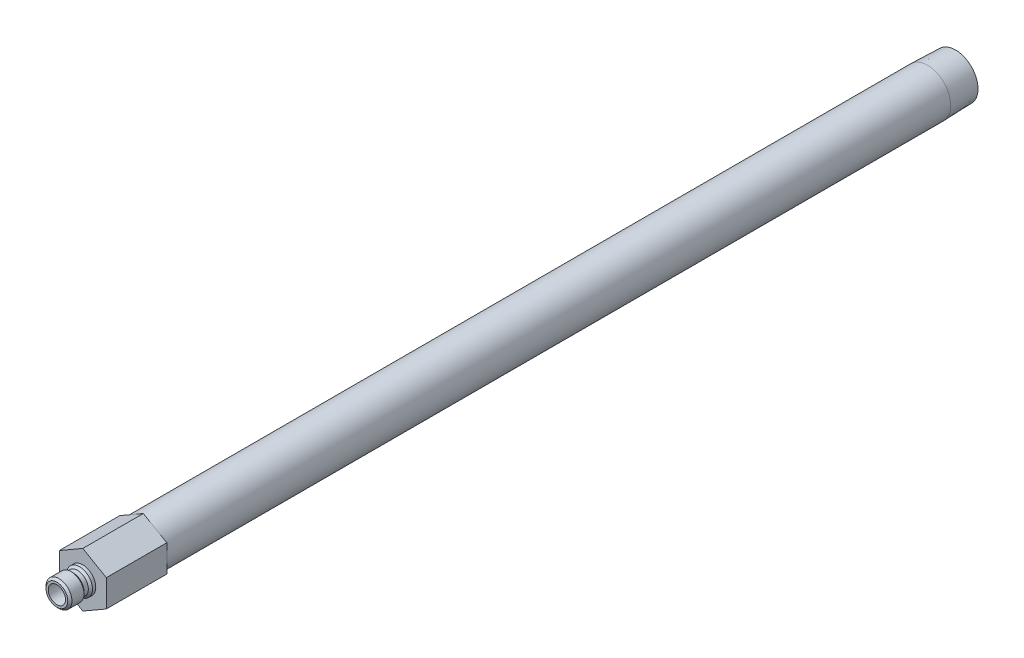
ISO-10303-21;
HEADER;
FILE_DESCRIPTION(('STEP AP214'),'2;1');
FILE_NAME('part.step','',(''),(''),'','','');
FILE_SCHEMA(('AUTOMOTIVE_DESIGN { 1 0 10303 214 1 1 1 1 }'));
ENDSEC;
DATA;
#1=APPLICATION_CONTEXT('core data for automotive mechanical design processes');
#2=APPLICATION_PROTOCOL_DEFINITION('international standard','automotive_design',2000,#1);
#3=PRODUCT_CONTEXT('',#1,'mechanical');
#4=PRODUCT('Part','Part','',(#3));
#5=PRODUCT_RELATED_PRODUCT_CATEGORY('part','',(#4));
#6=PRODUCT_DEFINITION_FORMATION('','',#4);
#7=PRODUCT_DEFINITION_CONTEXT('part definition',#1,'design');
#8=PRODUCT_DEFINITION('design','',#6,#7);
#9=PRODUCT_DEFINITION_SHAPE('','',#8);
#10=(LENGTH_UNIT() NAMED_UNIT(*) SI_UNIT(.MILLI.,.METRE.));
#11=(NAMED_UNIT(*) PLANE_ANGLE_UNIT() SI_UNIT($,.RADIAN.));
#12=(NAMED_UNIT(*) SI_UNIT($,.STERADIAN.) SOLID_ANGLE_UNIT());
#13=UNCERTAINTY_MEASURE_WITH_UNIT(LENGTH_MEASURE(1.E-05),#10,'distance_accuracy_value','');
#14=(GEOMETRIC_REPRESENTATION_CONTEXT(3) GLOBAL_UNCERTAINTY_ASSIGNED_CONTEXT((#13)) GLOBAL_UNIT_ASSIGNED_CONTEXT((#10,
#11,#12)) REPRESENTATION_CONTEXT('',''));
#15=CARTESIAN_POINT('',(0.,0.,0.));
#16=DIRECTION('',(0.,0.,1.));
#17=DIRECTION('',(1.,0.,0.));
#18=AXIS2_PLACEMENT_3D('',#15,#16,#17);
#19=CARTESIAN_POINT('',(0.,0.,0.));
#20=DIRECTION('',(0.,0.,-1.));
#21=DIRECTION('',(0.,1.,0.));
#22=AXIS2_PLACEMENT_3D('',#19,#20,#21);
#23=CYLINDRICAL_SURFACE('',#22,8.57249999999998);
#24=CARTESIAN_POINT('',(0.,0.,-310.3372));
#25=DIRECTION('',(0.,0.,-1.));
#26=DIRECTION('',(0.,1.,0.));
#27=AXIS2_PLACEMENT_3D('',#24,#25,#26);
#28=CIRCLE('',#27,8.57249999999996);
#29=CARTESIAN_POINT('',(0.,8.5725,-310.3372));
#30=VERTEX_POINT('',#29);
#31=EDGE_CURVE('E168',#30,#30,#28,.T.);
#32=ORIENTED_EDGE('',*,*,#31,.F.);
#33=EDGE_LOOP('',(#32));
#34=FACE_BOUND('',#33,.T.);
#35=CARTESIAN_POINT('',(0.,0.,-22.225));
#36=DIRECTION('',(0.,0.,1.));
#37=DIRECTION('',(1.,0.,0.));
#38=AXIS2_PLACEMENT_3D('',#35,#36,#37);
#39=CIRCLE('',#38,8.57249999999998);
#40=CARTESIAN_POINT('',(8.57249999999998,0.,-22.225));
#41=VERTEX_POINT('',#40);
#42=EDGE_CURVE('E37',#41,#41,#39,.F.);
#43=ORIENTED_EDGE('',*,*,#42,.T.);
#44=EDGE_LOOP('',(#43));
#45=FACE_BOUND('',#44,.T.);
#46=ADVANCED_FACE('F33',(#34,#45),#23,.T.);
#47=CARTESIAN_POINT('',(0.,0.,0.));
#48=DIRECTION('',(0.,0.,-1.));
#49=DIRECTION('',(0.,1.,0.));
#50=AXIS2_PLACEMENT_3D('',#47,#48,#49);
#51=CYLINDRICAL_SURFACE('',#50,3.175);
#52=CARTESIAN_POINT('',(0.,0.,9.525));
#53=DIRECTION('',(0.,0.,-1.));
#54=DIRECTION('',(0.,1.,0.));
#55=AXIS2_PLACEMENT_3D('',#52,#53,#54);
#56=CIRCLE('',#55,3.175);
#57=CARTESIAN_POINT('',(0.,3.175,9.525));
#58=VERTEX_POINT('',#57);
#59=EDGE_CURVE('E144',#58,#58,#56,.T.);
#60=ORIENTED_EDGE('',*,*,#59,.F.);
#61=EDGE_LOOP('',(#60));
#62=FACE_BOUND('',#61,.T.);
#63=CARTESIAN_POINT('',(0.,0.,-22.225));
#64=DIRECTION('',(0.,0.,-1.));
#65=DIRECTION('',(0.,1.,0.));
#66=AXIS2_PLACEMENT_3D('',#63,#64,#65);
#67=CIRCLE('',#66,3.17499999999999);
#68=CARTESIAN_POINT('',(0.,3.175,-22.225));
#69=VERTEX_POINT('',#68);
#70=EDGE_CURVE('E11',#69,#69,#67,.T.);
#71=ORIENTED_EDGE('',*,*,#70,.T.);
#72=EDGE_LOOP('',(#71));
#73=FACE_BOUND('',#72,.T.);
#74=ADVANCED_FACE('F35',(#62,#73),#51,.F.);
#75=CARTESIAN_POINT('',(0.,3.175,-22.225));
#76=DIRECTION('',(0.,0.,-1.));
#77=DIRECTION('',(0.,1.,0.));
#78=AXIS2_PLACEMENT_3D('',#75,#76,#77);
#79=PLANE('',#78);
#80=CARTESIAN_POINT('',(0.,0.,-22.225));
#81=DIRECTION('',(0.,0.,-1.));
#82=DIRECTION('',(0.,1.,0.));
#83=AXIS2_PLACEMENT_3D('',#80,#81,#82);
#84=CIRCLE('',#83,6.2611);
#85=CARTESIAN_POINT('',(0.,6.2611,-22.225));
#86=VERTEX_POINT('',#85);
#87=EDGE_CURVE('E43',#86,#86,#84,.T.);
#88=ORIENTED_EDGE('',*,*,#87,.T.);
#89=EDGE_LOOP('',(#88));
#90=FACE_BOUND('',#89,.T.);
#91=ORIENTED_EDGE('',*,*,#70,.F.);
#92=EDGE_LOOP('',(#91));
#93=FACE_BOUND('',#92,.T.);
#94=ADVANCED_FACE('F180',(#90,#93),#79,.T.);
#95=CARTESIAN_POINT('',(0.,0.,0.));
#96=DIRECTION('',(0.,0.,-1.));
#97=DIRECTION('',(0.,1.,0.));
#98=AXIS2_PLACEMENT_3D('',#95,#96,#97);
#99=CYLINDRICAL_SURFACE('',#98,6.26109999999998);
#100=CARTESIAN_POINT('',(0.,0.,-320.675));
#101=DIRECTION('',(0.,0.,-1.));
#102=DIRECTION('',(0.,1.,0.));
#103=AXIS2_PLACEMENT_3D('',#100,#101,#102);
#104=CIRCLE('',#103,6.26109999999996);
#105=CARTESIAN_POINT('',(0.,6.2611,-320.675));
#106=VERTEX_POINT('',#105);
#107=EDGE_CURVE('E174',#106,#106,#104,.T.);
#108=ORIENTED_EDGE('',*,*,#107,.T.);
#109=EDGE_LOOP('',(#108));
#110=FACE_BOUND('',#109,.T.);
#111=ORIENTED_EDGE('',*,*,#87,.F.);
#112=EDGE_LOOP('',(#111));
#113=FACE_BOUND('',#112,.T.);
#114=ADVANCED_FACE('F183',(#110,#113),#99,.F.);
#115=CARTESIAN_POINT('',(0.,8.24944566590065,-320.675));
#116=DIRECTION('',(0.,0.,-1.));
#117=DIRECTION('',(0.,1.,0.));
#118=AXIS2_PLACEMENT_3D('',#115,#116,#117);
#119=PLANE('',#118);
#120=CARTESIAN_POINT('',(0.,0.,-320.675));
#121=DIRECTION('',(0.,0.,-1.));
#122=DIRECTION('',(0.,1.,0.));
#123=AXIS2_PLACEMENT_3D('',#120,#121,#122);
#124=CIRCLE('',#123,8.24944566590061);
#125=CARTESIAN_POINT('',(0.,8.24944566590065,-320.675));
#126=VERTEX_POINT('',#125);
#127=EDGE_CURVE('E171',#126,#126,#124,.T.);
#128=ORIENTED_EDGE('',*,*,#127,.T.);
#129=EDGE_LOOP('',(#128));
#130=FACE_BOUND('',#129,.T.);
#131=ORIENTED_EDGE('',*,*,#107,.F.);
#132=EDGE_LOOP('',(#131));
#133=FACE_BOUND('',#132,.T.);
#134=ADVANCED_FACE('F185',(#130,#133),#119,.T.);
#135=CARTESIAN_POINT('',(0.,0.,-320.675));
#136=DIRECTION('',(0.,0.,1.));
#137=DIRECTION('',(0.,-1.,0.));
#138=AXIS2_PLACEMENT_3D('',#135,#136,#137);
#139=CONICAL_SURFACE('',#138,8.24944566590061,0.0312396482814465);
#140=ORIENTED_EDGE('',*,*,#31,.T.);
#141=EDGE_LOOP('',(#140));
#142=FACE_BOUND('',#141,.T.);
#143=ORIENTED_EDGE('',*,*,#127,.F.);
#144=EDGE_LOOP('',(#143));
#145=FACE_BOUND('',#144,.T.);
#146=ADVANCED_FACE('F192',(#142,#145),#139,.T.);
#147=CARTESIAN_POINT('',(0.,4.7625,0.));
#148=DIRECTION('',(0.,0.,1.));
#149=DIRECTION('',(0.,-1.,0.));
#150=AXIS2_PLACEMENT_3D('',#147,#148,#149);
#151=PLANE('',#150);
#152=CARTESIAN_POINT('',(0.,0.,0.));
#153=DIRECTION('',(0.,0.,-1.));
#154=DIRECTION('',(0.,1.,0.));
#155=AXIS2_PLACEMENT_3D('',#152,#153,#154);
#156=CIRCLE('',#155,4.7625);
#157=CARTESIAN_POINT('',(0.,4.7625,0.));
#158=VERTEX_POINT('',#157);
#159=EDGE_CURVE('E165',#158,#158,#156,.T.);
#160=ORIENTED_EDGE('',*,*,#159,.T.);
#161=EDGE_LOOP('',(#160));
#162=FACE_BOUND('',#161,.T.);
#163=DIRECTION('',(-0.866025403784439,-0.5,0.));
#164=VECTOR('',#163,1.);
#165=CARTESIAN_POINT('',(0.,9.97199384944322,0.));
#166=LINE('',#165,#164);
#167=CARTESIAN_POINT('',(0.,9.97199384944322,0.));
#168=VERTEX_POINT('',#167);
#169=CARTESIAN_POINT('',(-8.636,4.98599692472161,0.));
#170=VERTEX_POINT('',#169);
#171=EDGE_CURVE('E122',#168,#170,#166,.T.);
#172=ORIENTED_EDGE('',*,*,#171,.T.);
#173=DIRECTION('',(0.,-1.,0.));
#174=VECTOR('',#173,1.);
#175=CARTESIAN_POINT('',(-8.636,4.98599692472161,0.));
#176=LINE('',#175,#174);
#177=CARTESIAN_POINT('',(-8.636,-4.98599692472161,0.));
#178=VERTEX_POINT('',#177);
#179=EDGE_CURVE('E125',#170,#178,#176,.T.);
#180=ORIENTED_EDGE('',*,*,#179,.T.);
#181=DIRECTION('',(0.866025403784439,-0.5,0.));
#182=VECTOR('',#181,1.);
#183=CARTESIAN_POINT('',(-8.636,-4.98599692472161,0.));
#184=LINE('',#183,#182);
#185=CARTESIAN_POINT('',(0.,-9.97199384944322,0.));
#186=VERTEX_POINT('',#185);
#187=EDGE_CURVE('E128',#178,#186,#184,.T.);
#188=ORIENTED_EDGE('',*,*,#187,.T.);
#189=DIRECTION('',(0.866025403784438,0.5,0.));
#190=VECTOR('',#189,1.);
#191=CARTESIAN_POINT('',(0.,-9.97199384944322,0.));
#192=LINE('',#191,#190);
#193=CARTESIAN_POINT('',(8.636,-4.98599692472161,0.));
#194=VERTEX_POINT('',#193);
#195=EDGE_CURVE('E131',#186,#194,#192,.T.);
#196=ORIENTED_EDGE('',*,*,#195,.T.);
#197=DIRECTION('',(0.,1.,0.));
#198=VECTOR('',#197,1.);
#199=CARTESIAN_POINT('',(8.636,-4.98599692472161,0.));
#200=LINE('',#199,#198);
#201=CARTESIAN_POINT('',(8.636,4.98599692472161,0.));
#202=VERTEX_POINT('',#201);
#203=EDGE_CURVE('E99',#194,#202,#200,.T.);
#204=ORIENTED_EDGE('',*,*,#203,.T.);
#205=DIRECTION('',(-0.866025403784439,0.5,0.));
#206=VECTOR('',#205,1.);
#207=CARTESIAN_POINT('',(8.636,4.98599692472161,0.));
#208=LINE('',#207,#206);
#209=EDGE_CURVE('E134',#202,#168,#208,.T.);
#210=ORIENTED_EDGE('',*,*,#209,.T.);
#211=EDGE_LOOP('',(#172,#180,#188,#196,#204,#210));
#212=FACE_BOUND('',#211,.T.);
#213=ADVANCED_FACE('F206',(#162,#212),#151,.T.);
#214=CARTESIAN_POINT('',(0.,0.,0.));
#215=DIRECTION('',(0.,0.,-1.));
#216=DIRECTION('',(0.,1.,0.));
#217=AXIS2_PLACEMENT_3D('',#214,#215,#216);
#218=CYLINDRICAL_SURFACE('',#217,4.7625);
#219=CARTESIAN_POINT('',(0.,0.,1.2065));
#220=DIRECTION('',(0.,0.,-1.));
#221=DIRECTION('',(0.,1.,0.));
#222=AXIS2_PLACEMENT_3D('',#219,#220,#221);
#223=CIRCLE('',#222,4.7625);
#224=CARTESIAN_POINT('',(0.,4.7625,1.2065));
#225=VERTEX_POINT('',#224);
#226=EDGE_CURVE('E162',#225,#225,#223,.T.);
#227=ORIENTED_EDGE('',*,*,#226,.T.);
#228=EDGE_LOOP('',(#227));
#229=FACE_BOUND('',#228,.T.);
#230=ORIENTED_EDGE('',*,*,#159,.F.);
#231=EDGE_LOOP('',(#230));
#232=FACE_BOUND('',#231,.T.);
#233=ADVANCED_FACE('F213',(#229,#232),#218,.T.);
#234=CARTESIAN_POINT('',(0.,0.,1.2065));
#235=DIRECTION('',(0.,0.,-1.));
#236=DIRECTION('',(0.,1.,0.));
#237=AXIS2_PLACEMENT_3D('',#234,#235,#236);
#238=CONICAL_SURFACE('',#237,4.7625,0.785398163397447);
#239=CARTESIAN_POINT('',(0.,0.,1.9685));
#240=DIRECTION('',(0.,0.,-1.));
#241=DIRECTION('',(0.,1.,0.));
#242=AXIS2_PLACEMENT_3D('',#239,#240,#241);
#243=CIRCLE('',#242,4.0005);
#244=CARTESIAN_POINT('',(0.,4.0005,1.9685));
#245=VERTEX_POINT('',#244);
#246=EDGE_CURVE('E159',#245,#245,#243,.T.);
#247=ORIENTED_EDGE('',*,*,#246,.T.);
#248=EDGE_LOOP('',(#247));
#249=FACE_BOUND('',#248,.T.);
#250=ORIENTED_EDGE('',*,*,#226,.F.);
#251=EDGE_LOOP('',(#250));
#252=FACE_BOUND('',#251,.T.);
#253=ADVANCED_FACE('F222',(#249,#252),#238,.T.);
#254=CARTESIAN_POINT('',(0.,0.,0.));
#255=DIRECTION('',(0.,0.,-1.));
#256=DIRECTION('',(0.,1.,0.));
#257=AXIS2_PLACEMENT_3D('',#254,#255,#256);
#258=CYLINDRICAL_SURFACE('',#257,4.0005);
#259=CARTESIAN_POINT('',(0.,0.,3.556));
#260=DIRECTION('',(0.,0.,-1.));
#261=DIRECTION('',(0.,1.,0.));
#262=AXIS2_PLACEMENT_3D('',#259,#260,#261);
#263=CIRCLE('',#262,4.0005);
#264=CARTESIAN_POINT('',(0.,4.0005,3.556));
#265=VERTEX_POINT('',#264);
#266=EDGE_CURVE('E156',#265,#265,#263,.T.);
#267=ORIENTED_EDGE('',*,*,#266,.T.);
#268=EDGE_LOOP('',(#267));
#269=FACE_BOUND('',#268,.T.);
#270=ORIENTED_EDGE('',*,*,#246,.F.);
#271=EDGE_LOOP('',(#270));
#272=FACE_BOUND('',#271,.T.);
#273=ADVANCED_FACE('F263',(#269,#272),#258,.T.);
#274=CARTESIAN_POINT('',(0.,0.,3.556));
#275=DIRECTION('',(0.,0.,1.));
#276=DIRECTION('',(0.,-1.,0.));
#277=AXIS2_PLACEMENT_3D('',#274,#275,#276);
#278=CONICAL_SURFACE('',#277,4.0005,0.785398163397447);
#279=CARTESIAN_POINT('',(0.,0.,4.318));
#280=DIRECTION('',(0.,0.,-1.));
#281=DIRECTION('',(0.,1.,0.));
#282=AXIS2_PLACEMENT_3D('',#279,#280,#281);
#283=CIRCLE('',#282,4.7625);
#284=CARTESIAN_POINT('',(0.,4.7625,4.318));
#285=VERTEX_POINT('',#284);
#286=EDGE_CURVE('E153',#285,#285,#283,.T.);
#287=ORIENTED_EDGE('',*,*,#286,.T.);
#288=EDGE_LOOP('',(#287));
#289=FACE_BOUND('',#288,.T.);
#290=ORIENTED_EDGE('',*,*,#266,.F.);
#291=EDGE_LOOP('',(#290));
#292=FACE_BOUND('',#291,.T.);
#293=ADVANCED_FACE('F259',(#289,#292),#278,.T.);
#294=CARTESIAN_POINT('',(0.,0.,0.));
#295=DIRECTION('',(0.,0.,-1.));
#296=DIRECTION('',(0.,1.,0.));
#297=AXIS2_PLACEMENT_3D('',#294,#295,#296);
#298=CYLINDRICAL_SURFACE('',#297,4.7625);
#299=CARTESIAN_POINT('',(0.,0.,8.763));
#300=DIRECTION('',(0.,0.,-1.));
#301=DIRECTION('',(0.,1.,0.));
#302=AXIS2_PLACEMENT_3D('',#299,#300,#301);
#303=CIRCLE('',#302,4.7625);
#304=CARTESIAN_POINT('',(0.,4.7625,8.763));
#305=VERTEX_POINT('',#304);
#306=EDGE_CURVE('E150',#305,#305,#303,.T.);
#307=ORIENTED_EDGE('',*,*,#306,.T.);
#308=EDGE_LOOP('',(#307));
#309=FACE_BOUND('',#308,.T.);
#310=ORIENTED_EDGE('',*,*,#286,.F.);
#311=EDGE_LOOP('',(#310));
#312=FACE_BOUND('',#311,.T.);
#313=ADVANCED_FACE('F255',(#309,#312),#298,.T.);
#314=CARTESIAN_POINT('',(0.,0.,8.763));
#315=DIRECTION('',(0.,0.,-1.));
#316=DIRECTION('',(0.,1.,0.));
#317=AXIS2_PLACEMENT_3D('',#314,#315,#316);
#318=CONICAL_SURFACE('',#317,4.7625,0.785398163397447);
#319=CARTESIAN_POINT('',(0.,0.,9.525));
#320=DIRECTION('',(0.,0.,-1.));
#321=DIRECTION('',(0.,1.,0.));
#322=AXIS2_PLACEMENT_3D('',#319,#320,#321);
#323=CIRCLE('',#322,4.0005);
#324=CARTESIAN_POINT('',(0.,4.0005,9.525));
#325=VERTEX_POINT('',#324);
#326=EDGE_CURVE('E147',#325,#325,#323,.T.);
#327=ORIENTED_EDGE('',*,*,#326,.T.);
#328=EDGE_LOOP('',(#327));
#329=FACE_BOUND('',#328,.T.);
#330=ORIENTED_EDGE('',*,*,#306,.F.);
#331=EDGE_LOOP('',(#330));
#332=FACE_BOUND('',#331,.T.);
#333=ADVANCED_FACE('F251',(#329,#332),#318,.T.);
#334=CARTESIAN_POINT('',(0.,3.175,9.525));
#335=DIRECTION('',(0.,0.,1.));
#336=DIRECTION('',(0.,-1.,0.));
#337=AXIS2_PLACEMENT_3D('',#334,#335,#336);
#338=PLANE('',#337);
#339=ORIENTED_EDGE('',*,*,#59,.T.);
#340=EDGE_LOOP('',(#339));
#341=FACE_BOUND('',#340,.T.);
#342=ORIENTED_EDGE('',*,*,#326,.F.);
#343=EDGE_LOOP('',(#342));
#344=FACE_BOUND('',#343,.T.);
#345=ADVANCED_FACE('F239',(#341,#344),#338,.T.);
#346=CARTESIAN_POINT('',(0.,9.97199384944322,-22.225));
#347=DIRECTION('',(-0.5,0.866025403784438,0.));
#348=DIRECTION('',(-0.866025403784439,-0.5,0.));
#349=AXIS2_PLACEMENT_3D('',#346,#347,#348);
#350=PLANE('',#349);
#351=ORIENTED_EDGE('',*,*,#171,.F.);
#352=DIRECTION('',(0.,0.,1.));
#353=VECTOR('',#352,1.);
#354=CARTESIAN_POINT('',(0.,9.97199384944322,-22.225));
#355=LINE('',#354,#353);
#356=CARTESIAN_POINT('',(0.,9.97199384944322,-22.225));
#357=VERTEX_POINT('',#356);
#358=EDGE_CURVE('E51',#357,#168,#355,.T.);
#359=ORIENTED_EDGE('',*,*,#358,.F.);
#360=DIRECTION('',(-0.866025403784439,-0.5,0.));
#361=VECTOR('',#360,1.);
#362=CARTESIAN_POINT('',(0.,9.97199384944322,-22.225));
#363=LINE('',#362,#361);
#364=CARTESIAN_POINT('',(-8.636,4.98599692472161,-22.225));
#365=VERTEX_POINT('',#364);
#366=EDGE_CURVE('E137',#357,#365,#363,.T.);
#367=ORIENTED_EDGE('',*,*,#366,.T.);
#368=DIRECTION('',(0.,0.,1.));
#369=VECTOR('',#368,1.);
#370=CARTESIAN_POINT('',(-8.636,4.98599692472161,-22.225));
#371=LINE('',#370,#369);
#372=EDGE_CURVE('E86',#365,#170,#371,.T.);
#373=ORIENTED_EDGE('',*,*,#372,.T.);
#374=EDGE_LOOP('',(#351,#359,#367,#373));
#375=FACE_BOUND('',#374,.T.);
#376=ADVANCED_FACE('F226',(#375),#350,.T.);
#377=CARTESIAN_POINT('',(8.636,4.98599692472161,-22.225));
#378=DIRECTION('',(0.5,0.866025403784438,0.));
#379=DIRECTION('',(-0.866025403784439,0.5,0.));
#380=AXIS2_PLACEMENT_3D('',#377,#378,#379);
#381=PLANE('',#380);
#382=ORIENTED_EDGE('',*,*,#209,.F.);
#383=DIRECTION('',(0.,0.,1.));
#384=VECTOR('',#383,1.);
#385=CARTESIAN_POINT('',(8.636,4.98599692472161,-22.225));
#386=LINE('',#385,#384);
#387=CARTESIAN_POINT('',(8.636,4.98599692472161,-22.225));
#388=VERTEX_POINT('',#387);
#389=EDGE_CURVE('E74',#388,#202,#386,.T.);
#390=ORIENTED_EDGE('',*,*,#389,.F.);
#391=DIRECTION('',(-0.866025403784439,0.5,0.));
#392=VECTOR('',#391,1.);
#393=CARTESIAN_POINT('',(8.636,4.98599692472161,-22.225));
#394=LINE('',#393,#392);
#395=EDGE_CURVE('E112',#388,#357,#394,.T.);
#396=ORIENTED_EDGE('',*,*,#395,.T.);
#397=ORIENTED_EDGE('',*,*,#358,.T.);
#398=EDGE_LOOP('',(#382,#390,#396,#397));
#399=FACE_BOUND('',#398,.T.);
#400=ADVANCED_FACE('F231',(#399),#381,.T.);
#401=CARTESIAN_POINT('',(8.636,-4.98599692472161,-22.225));
#402=DIRECTION('',(1.,0.,0.));
#403=DIRECTION('',(0.,1.,0.));
#404=AXIS2_PLACEMENT_3D('',#401,#402,#403);
#405=PLANE('',#404);
#406=ORIENTED_EDGE('',*,*,#203,.F.);
#407=DIRECTION('',(0.,0.,1.));
#408=VECTOR('',#407,1.);
#409=CARTESIAN_POINT('',(8.636,-4.98599692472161,-22.225));
#410=LINE('',#409,#408);
#411=CARTESIAN_POINT('',(8.636,-4.98599692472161,-22.225));
#412=VERTEX_POINT('',#411);
#413=EDGE_CURVE('E94',#412,#194,#410,.T.);
#414=ORIENTED_EDGE('',*,*,#413,.F.);
#415=DIRECTION('',(0.,1.,0.));
#416=VECTOR('',#415,1.);
#417=CARTESIAN_POINT('',(8.636,-4.98599692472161,-22.225));
#418=LINE('',#417,#416);
#419=EDGE_CURVE('E97',#412,#388,#418,.T.);
#420=ORIENTED_EDGE('',*,*,#419,.T.);
#421=ORIENTED_EDGE('',*,*,#389,.T.);
#422=EDGE_LOOP('',(#406,#414,#420,#421));
#423=FACE_BOUND('',#422,.T.);
#424=ADVANCED_FACE('F96',(#423),#405,.T.);
#425=CARTESIAN_POINT('',(0.,-9.97199384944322,-22.225));
#426=DIRECTION('',(0.5,-0.866025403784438,0.));
#427=DIRECTION('',(0.866025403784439,0.5,0.));
#428=AXIS2_PLACEMENT_3D('',#425,#426,#427);
#429=PLANE('',#428);
#430=ORIENTED_EDGE('',*,*,#195,.F.);
#431=DIRECTION('',(0.,0.,1.));
#432=VECTOR('',#431,1.);
#433=CARTESIAN_POINT('',(0.,-9.97199384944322,-22.225));
#434=LINE('',#433,#432);
#435=CARTESIAN_POINT('',(0.,-9.97199384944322,-22.225));
#436=VERTEX_POINT('',#435);
#437=EDGE_CURVE('E104',#436,#186,#434,.T.);
#438=ORIENTED_EDGE('',*,*,#437,.F.);
#439=DIRECTION('',(0.866025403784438,0.5,0.));
#440=VECTOR('',#439,1.);
#441=CARTESIAN_POINT('',(0.,-9.97199384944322,-22.225));
#442=LINE('',#441,#440);
#443=EDGE_CURVE('E110',#436,#412,#442,.T.);
#444=ORIENTED_EDGE('',*,*,#443,.T.);
#445=ORIENTED_EDGE('',*,*,#413,.T.);
#446=EDGE_LOOP('',(#430,#438,#444,#445));
#447=FACE_BOUND('',#446,.T.);
#448=ADVANCED_FACE('F114',(#447),#429,.T.);
#449=CARTESIAN_POINT('',(-8.636,-4.98599692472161,-22.225));
#450=DIRECTION('',(-0.5,-0.866025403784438,0.));
#451=DIRECTION('',(0.866025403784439,-0.5,0.));
#452=AXIS2_PLACEMENT_3D('',#449,#450,#451);
#453=PLANE('',#452);
#454=ORIENTED_EDGE('',*,*,#187,.F.);
#455=DIRECTION('',(0.,0.,1.));
#456=VECTOR('',#455,1.);
#457=CARTESIAN_POINT('',(-8.636,-4.98599692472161,-22.225));
#458=LINE('',#457,#456);
#459=CARTESIAN_POINT('',(-8.636,-4.98599692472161,-22.225));
#460=VERTEX_POINT('',#459);
#461=EDGE_CURVE('E141',#460,#178,#458,.T.);
#462=ORIENTED_EDGE('',*,*,#461,.F.);
#463=DIRECTION('',(0.866025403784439,-0.5,0.));
#464=VECTOR('',#463,1.);
#465=CARTESIAN_POINT('',(-8.636,-4.98599692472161,-22.225));
#466=LINE('',#465,#464);
#467=EDGE_CURVE('E115',#460,#436,#466,.T.);
#468=ORIENTED_EDGE('',*,*,#467,.T.);
#469=ORIENTED_EDGE('',*,*,#437,.T.);
#470=EDGE_LOOP('',(#454,#462,#468,#469));
#471=FACE_BOUND('',#470,.T.);
#472=ADVANCED_FACE('F230',(#471),#453,.T.);
#473=CARTESIAN_POINT('',(-8.636,4.98599692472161,-22.225));
#474=DIRECTION('',(-1.,0.,0.));
#475=DIRECTION('',(0.,0.,1.));
#476=AXIS2_PLACEMENT_3D('',#473,#474,#475);
#477=PLANE('',#476);
#478=ORIENTED_EDGE('',*,*,#179,.F.);
#479=ORIENTED_EDGE('',*,*,#372,.F.);
#480=DIRECTION('',(0.,-1.,0.));
#481=VECTOR('',#480,1.);
#482=CARTESIAN_POINT('',(-8.636,4.98599692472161,-22.225));
#483=LINE('',#482,#481);
#484=EDGE_CURVE('E117',#365,#460,#483,.T.);
#485=ORIENTED_EDGE('',*,*,#484,.T.);
#486=ORIENTED_EDGE('',*,*,#461,.T.);
#487=EDGE_LOOP('',(#478,#479,#485,#486));
#488=FACE_BOUND('',#487,.T.);
#489=ADVANCED_FACE('F227',(#488),#477,.T.);
#490=CARTESIAN_POINT('',(-8.636,4.98599692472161,-22.225));
#491=DIRECTION('',(0.,0.,1.));
#492=DIRECTION('',(1.,0.,0.));
#493=AXIS2_PLACEMENT_3D('',#490,#491,#492);
#494=PLANE('',#493);
#495=ORIENTED_EDGE('',*,*,#42,.F.);
#496=EDGE_LOOP('',(#495));
#497=FACE_BOUND('',#496,.T.);
#498=ORIENTED_EDGE('',*,*,#366,.F.);
#499=ORIENTED_EDGE('',*,*,#395,.F.);
#500=ORIENTED_EDGE('',*,*,#419,.F.);
#501=ORIENTED_EDGE('',*,*,#443,.F.);
#502=ORIENTED_EDGE('',*,*,#467,.F.);
#503=ORIENTED_EDGE('',*,*,#484,.F.);
#504=EDGE_LOOP('',(#498,#499,#500,#501,#502,#503));
#505=FACE_BOUND('',#504,.T.);
#506=ADVANCED_FACE('F108',(#497,#505),#494,.F.);
#507=CLOSED_SHELL('',(#46,#74,#94,#114,#134,#146,#213,#233,#253,#273,#293,#313,#333,#345,#376,
#400,#424,#448,#472,#489,#506));
#508=MANIFOLD_SOLID_BREP('B2',#507);
#509=ADVANCED_BREP_SHAPE_REPRESENTATION('',(#18,#508),#14);
#510=SHAPE_DEFINITION_REPRESENTATION(#9,#509);
ENDSEC;
END-ISO-10303-21;
